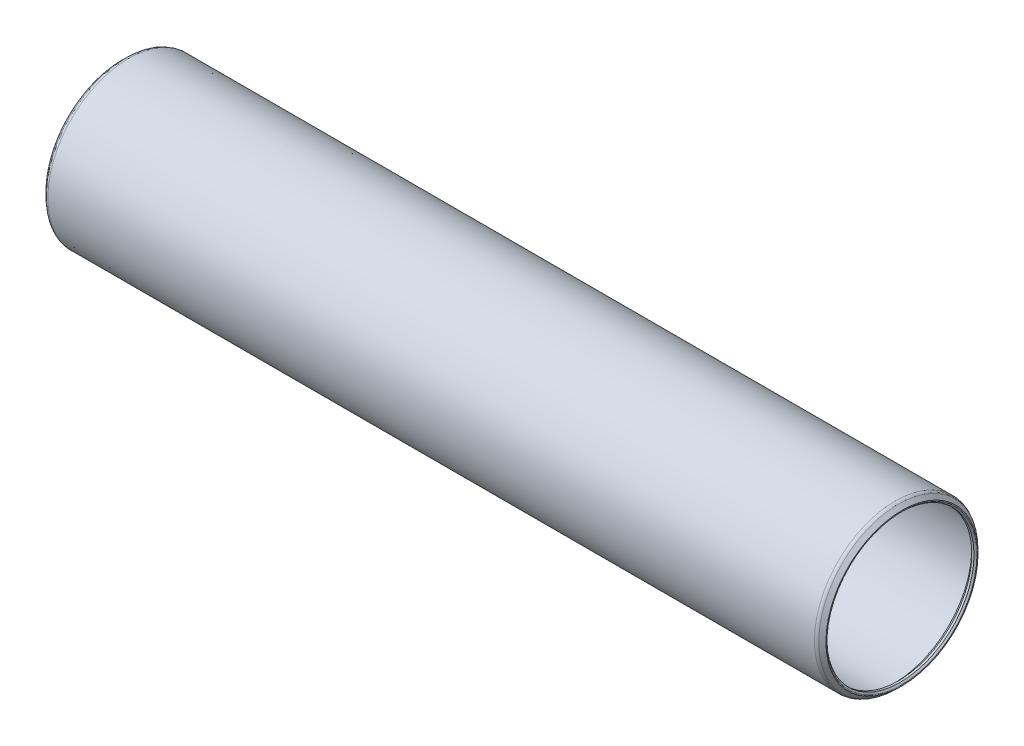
ISO-10303-21;
HEADER;
FILE_DESCRIPTION(('STEP AP214'),'2;1');
FILE_NAME('part.step','',(''),(''),'','','');
FILE_SCHEMA(('AUTOMOTIVE_DESIGN { 1 0 10303 214 1 1 1 1 }'));
ENDSEC;
DATA;
#1=APPLICATION_CONTEXT('core data for automotive mechanical design processes');
#2=APPLICATION_PROTOCOL_DEFINITION('international standard','automotive_design',2000,#1);
#3=PRODUCT_CONTEXT('',#1,'mechanical');
#4=PRODUCT('Part','Part','',(#3));
#5=PRODUCT_RELATED_PRODUCT_CATEGORY('part','',(#4));
#6=PRODUCT_DEFINITION_FORMATION('','',#4);
#7=PRODUCT_DEFINITION_CONTEXT('part definition',#1,'design');
#8=PRODUCT_DEFINITION('design','',#6,#7);
#9=PRODUCT_DEFINITION_SHAPE('','',#8);
#10=(LENGTH_UNIT() NAMED_UNIT(*) SI_UNIT(.MILLI.,.METRE.));
#11=(NAMED_UNIT(*) PLANE_ANGLE_UNIT() SI_UNIT($,.RADIAN.));
#12=(NAMED_UNIT(*) SI_UNIT($,.STERADIAN.) SOLID_ANGLE_UNIT());
#13=UNCERTAINTY_MEASURE_WITH_UNIT(LENGTH_MEASURE(1.E-05),#10,'distance_accuracy_value','');
#14=(GEOMETRIC_REPRESENTATION_CONTEXT(3) GLOBAL_UNCERTAINTY_ASSIGNED_CONTEXT((#13)) GLOBAL_UNIT_ASSIGNED_CONTEXT((#10,
#11,#12)) REPRESENTATION_CONTEXT('',''));
#15=CARTESIAN_POINT('',(0.,0.,0.));
#16=DIRECTION('',(0.,0.,1.));
#17=DIRECTION('',(1.,0.,0.));
#18=AXIS2_PLACEMENT_3D('',#15,#16,#17);
#19=CARTESIAN_POINT('',(134.9629,0.,0.));
#20=DIRECTION('',(-1.,0.,0.));
#21=DIRECTION('',(0.,0.,1.));
#22=AXIS2_PLACEMENT_3D('',#19,#20,#21);
#23=CYLINDRICAL_SURFACE('',#22,13.60805);
#24=CARTESIAN_POINT('',(0.762000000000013,0.,0.));
#25=DIRECTION('',(1.,0.,0.));
#26=DIRECTION('',(0.,0.,-1.));
#27=AXIS2_PLACEMENT_3D('',#24,#25,#26);
#28=CIRCLE('',#27,13.60805);
#29=CARTESIAN_POINT('',(0.762000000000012,0.,-13.60805));
#30=VERTEX_POINT('',#29);
#31=EDGE_CURVE('E117',#30,#30,#28,.F.);
#32=ORIENTED_EDGE('',*,*,#31,.T.);
#33=EDGE_LOOP('',(#32));
#34=FACE_BOUND('',#33,.T.);
#35=CARTESIAN_POINT('',(134.2009,0.,0.));
#36=DIRECTION('',(-1.,0.,0.));
#37=DIRECTION('',(0.,0.,1.));
#38=AXIS2_PLACEMENT_3D('',#35,#36,#37);
#39=CIRCLE('',#38,13.60805);
#40=CARTESIAN_POINT('',(134.2009,0.,13.60805));
#41=VERTEX_POINT('',#40);
#42=EDGE_CURVE('E112',#41,#41,#39,.F.);
#43=ORIENTED_EDGE('',*,*,#42,.T.);
#44=EDGE_LOOP('',(#43));
#45=FACE_BOUND('',#44,.T.);
#46=ADVANCED_FACE('F15',(#34,#45),#23,.F.);
#47=CARTESIAN_POINT('',(0.762000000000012,0.,0.));
#48=DIRECTION('',(1.,0.,0.));
#49=DIRECTION('',(0.,1.,0.));
#50=AXIS2_PLACEMENT_3D('',#47,#48,#49);
#51=CONICAL_SURFACE('',#50,13.60805,0.78539816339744);
#52=CARTESIAN_POINT('',(0.,0.,0.));
#53=DIRECTION('',(-1.,0.,0.));
#54=DIRECTION('',(0.,0.,1.));
#55=AXIS2_PLACEMENT_3D('',#52,#53,#54);
#56=CIRCLE('',#55,12.84605);
#57=CARTESIAN_POINT('',(0.,0.,12.84605));
#58=VERTEX_POINT('',#57);
#59=EDGE_CURVE('E107',#58,#58,#56,.T.);
#60=ORIENTED_EDGE('',*,*,#59,.T.);
#61=EDGE_LOOP('',(#60));
#62=FACE_BOUND('',#61,.T.);
#63=ORIENTED_EDGE('',*,*,#31,.F.);
#64=EDGE_LOOP('',(#63));
#65=FACE_BOUND('',#64,.T.);
#66=ADVANCED_FACE('F124',(#62,#65),#51,.F.);
#67=CARTESIAN_POINT('',(134.2009,0.,0.));
#68=DIRECTION('',(-1.,0.,0.));
#69=DIRECTION('',(0.,0.,1.));
#70=AXIS2_PLACEMENT_3D('',#67,#68,#69);
#71=CONICAL_SURFACE('',#70,13.60805,0.785398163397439);
#72=ORIENTED_EDGE('',*,*,#42,.F.);
#73=EDGE_LOOP('',(#72));
#74=FACE_BOUND('',#73,.T.);
#75=CARTESIAN_POINT('',(134.9629,0.,0.));
#76=DIRECTION('',(-1.,0.,0.));
#77=DIRECTION('',(0.,0.,1.));
#78=AXIS2_PLACEMENT_3D('',#75,#76,#77);
#79=CIRCLE('',#78,12.84605);
#80=CARTESIAN_POINT('',(134.9629,0.,12.84605));
#81=VERTEX_POINT('',#80);
#82=EDGE_CURVE('E102',#81,#81,#79,.F.);
#83=ORIENTED_EDGE('',*,*,#82,.T.);
#84=EDGE_LOOP('',(#83));
#85=FACE_BOUND('',#84,.T.);
#86=ADVANCED_FACE('F126',(#74,#85),#71,.F.);
#87=CARTESIAN_POINT('',(134.9629,0.,0.));
#88=DIRECTION('',(-1.,0.,0.));
#89=DIRECTION('',(0.,0.,1.));
#90=AXIS2_PLACEMENT_3D('',#87,#88,#89);
#91=CYLINDRICAL_SURFACE('',#90,12.84605);
#92=CARTESIAN_POINT('',(-0.380999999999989,0.,0.));
#93=DIRECTION('',(-1.,0.,0.));
#94=DIRECTION('',(0.,0.,1.));
#95=AXIS2_PLACEMENT_3D('',#92,#93,#94);
#96=CIRCLE('',#95,12.84605);
#97=CARTESIAN_POINT('',(-0.380999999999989,0.,12.84605));
#98=VERTEX_POINT('',#97);
#99=EDGE_CURVE('E97',#98,#98,#96,.T.);
#100=ORIENTED_EDGE('',*,*,#99,.T.);
#101=EDGE_LOOP('',(#100));
#102=FACE_BOUND('',#101,.T.);
#103=ORIENTED_EDGE('',*,*,#59,.F.);
#104=EDGE_LOOP('',(#103));
#105=FACE_BOUND('',#104,.T.);
#106=ADVANCED_FACE('F133',(#102,#105),#91,.F.);
#107=CARTESIAN_POINT('',(134.9629,0.,0.));
#108=DIRECTION('',(-1.,0.,0.));
#109=DIRECTION('',(0.,0.,1.));
#110=AXIS2_PLACEMENT_3D('',#107,#108,#109);
#111=CYLINDRICAL_SURFACE('',#110,12.84605);
#112=ORIENTED_EDGE('',*,*,#82,.F.);
#113=EDGE_LOOP('',(#112));
#114=FACE_BOUND('',#113,.T.);
#115=CARTESIAN_POINT('',(135.3439,0.,0.));
#116=DIRECTION('',(1.,0.,0.));
#117=DIRECTION('',(0.,0.,-1.));
#118=AXIS2_PLACEMENT_3D('',#115,#116,#117);
#119=CIRCLE('',#118,12.84605);
#120=CARTESIAN_POINT('',(135.3439,0.,-12.84605));
#121=VERTEX_POINT('',#120);
#122=EDGE_CURVE('E92',#121,#121,#119,.T.);
#123=ORIENTED_EDGE('',*,*,#122,.T.);
#124=EDGE_LOOP('',(#123));
#125=FACE_BOUND('',#124,.T.);
#126=ADVANCED_FACE('F153',(#114,#125),#111,.F.);
#127=CARTESIAN_POINT('',(-0.639512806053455,0.,0.));
#128=DIRECTION('',(-1.,0.,0.));
#129=DIRECTION('',(0.,0.,1.));
#130=AXIS2_PLACEMENT_3D('',#127,#128,#129);
#131=CONICAL_SURFACE('',#130,13.1045628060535,0.785398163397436);
#132=CARTESIAN_POINT('',(-0.639512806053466,0.,0.));
#133=DIRECTION('',(1.,0.,0.));
#134=DIRECTION('',(0.,0.,-1.));
#135=AXIS2_PLACEMENT_3D('',#132,#133,#134);
#136=CIRCLE('',#135,13.1045628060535);
#137=CARTESIAN_POINT('',(-0.639512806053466,0.,-13.1045628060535));
#138=VERTEX_POINT('',#137);
#139=EDGE_CURVE('E89',#138,#138,#136,.T.);
#140=ORIENTED_EDGE('',*,*,#139,.F.);
#141=EDGE_LOOP('',(#140));
#142=FACE_BOUND('',#141,.T.);
#143=ORIENTED_EDGE('',*,*,#99,.F.);
#144=EDGE_LOOP('',(#143));
#145=FACE_BOUND('',#144,.T.);
#146=ADVANCED_FACE('F150',(#142,#145),#131,.F.);
#147=CARTESIAN_POINT('',(135.602412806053,0.,0.));
#148=DIRECTION('',(1.,0.,0.));
#149=DIRECTION('',(0.,0.,-1.));
#150=AXIS2_PLACEMENT_3D('',#147,#148,#149);
#151=CONICAL_SURFACE('',#150,13.1045628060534,0.785398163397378);
#152=ORIENTED_EDGE('',*,*,#122,.F.);
#153=EDGE_LOOP('',(#152));
#154=FACE_BOUND('',#153,.T.);
#155=CARTESIAN_POINT('',(135.602412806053,0.,0.));
#156=DIRECTION('',(1.,0.,0.));
#157=DIRECTION('',(0.,0.,-1.));
#158=AXIS2_PLACEMENT_3D('',#155,#156,#157);
#159=CIRCLE('',#158,13.1045628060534);
#160=CARTESIAN_POINT('',(135.602412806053,0.,-13.1045628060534));
#161=VERTEX_POINT('',#160);
#162=EDGE_CURVE('E67',#161,#161,#159,.F.);
#163=ORIENTED_EDGE('',*,*,#162,.F.);
#164=EDGE_LOOP('',(#163));
#165=FACE_BOUND('',#164,.T.);
#166=ADVANCED_FACE('F83',(#154,#165),#151,.F.);
#167=CARTESIAN_POINT('',(-0.549710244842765,0.,0.));
#168=DIRECTION('',(1.,0.,0.));
#169=DIRECTION('',(0.,0.,-1.));
#170=AXIS2_PLACEMENT_3D('',#167,#168,#169);
#171=TOROIDAL_SURFACE('',#170,13.1943653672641,0.127000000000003);
#172=CARTESIAN_POINT('',(-0.639512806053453,0.,0.));
#173=DIRECTION('',(1.,0.,0.));
#174=DIRECTION('',(0.,0.,-1.));
#175=AXIS2_PLACEMENT_3D('',#172,#173,#174);
#176=CIRCLE('',#175,13.2841679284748);
#177=CARTESIAN_POINT('',(-0.639512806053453,0.,-13.2841679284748));
#178=VERTEX_POINT('',#177);
#179=EDGE_CURVE('E62',#178,#178,#176,.T.);
#180=ORIENTED_EDGE('',*,*,#179,.F.);
#181=EDGE_LOOP('',(#180));
#182=FACE_BOUND('',#181,.T.);
#183=ORIENTED_EDGE('',*,*,#139,.T.);
#184=EDGE_LOOP('',(#183));
#185=FACE_BOUND('',#184,.T.);
#186=ADVANCED_FACE('F78',(#182,#185),#171,.T.);
#187=CARTESIAN_POINT('',(135.512610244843,0.,0.));
#188=DIRECTION('',(1.,0.,0.));
#189=DIRECTION('',(0.,0.,-1.));
#190=AXIS2_PLACEMENT_3D('',#187,#188,#189);
#191=TOROIDAL_SURFACE('',#190,13.1943653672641,0.127000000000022);
#192=ORIENTED_EDGE('',*,*,#162,.T.);
#193=EDGE_LOOP('',(#192));
#194=FACE_BOUND('',#193,.T.);
#195=CARTESIAN_POINT('',(135.602412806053,0.,0.));
#196=DIRECTION('',(-1.,0.,0.));
#197=DIRECTION('',(0.,0.,1.));
#198=AXIS2_PLACEMENT_3D('',#195,#196,#197);
#199=CIRCLE('',#198,13.2841679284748);
#200=CARTESIAN_POINT('',(135.602412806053,0.,13.2841679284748));
#201=VERTEX_POINT('',#200);
#202=EDGE_CURVE('E57',#201,#201,#199,.T.);
#203=ORIENTED_EDGE('',*,*,#202,.F.);
#204=EDGE_LOOP('',(#203));
#205=FACE_BOUND('',#204,.T.);
#206=ADVANCED_FACE('F74',(#194,#205),#191,.T.);
#207=CARTESIAN_POINT('',(-0.0117653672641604,0.,0.));
#208=DIRECTION('',(1.,0.,0.));
#209=DIRECTION('',(0.,1.,0.));
#210=AXIS2_PLACEMENT_3D('',#207,#208,#209);
#211=CONICAL_SURFACE('',#210,13.9119153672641,0.785398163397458);
#212=CARTESIAN_POINT('',(-0.0117653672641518,0.,0.));
#213=DIRECTION('',(1.,0.,0.));
#214=DIRECTION('',(0.,0.,-1.));
#215=AXIS2_PLACEMENT_3D('',#212,#213,#214);
#216=CIRCLE('',#215,13.9119153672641);
#217=CARTESIAN_POINT('',(-0.0117653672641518,0.,-13.9119153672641));
#218=VERTEX_POINT('',#217);
#219=EDGE_CURVE('E54',#218,#218,#216,.T.);
#220=ORIENTED_EDGE('',*,*,#219,.F.);
#221=EDGE_LOOP('',(#220));
#222=FACE_BOUND('',#221,.T.);
#223=ORIENTED_EDGE('',*,*,#179,.T.);
#224=EDGE_LOOP('',(#223));
#225=FACE_BOUND('',#224,.T.);
#226=ADVANCED_FACE('F77',(#222,#225),#211,.T.);
#227=CARTESIAN_POINT('',(134.974665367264,0.,0.));
#228=DIRECTION('',(-1.,0.,0.));
#229=DIRECTION('',(0.,0.,1.));
#230=AXIS2_PLACEMENT_3D('',#227,#228,#229);
#231=CONICAL_SURFACE('',#230,13.911915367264,0.785398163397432);
#232=ORIENTED_EDGE('',*,*,#202,.T.);
#233=EDGE_LOOP('',(#232));
#234=FACE_BOUND('',#233,.T.);
#235=CARTESIAN_POINT('',(134.974665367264,0.,0.));
#236=DIRECTION('',(1.,0.,0.));
#237=DIRECTION('',(0.,0.,-1.));
#238=AXIS2_PLACEMENT_3D('',#235,#236,#237);
#239=CIRCLE('',#238,13.9119153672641);
#240=CARTESIAN_POINT('',(134.974665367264,0.,-13.9119153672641));
#241=VERTEX_POINT('',#240);
#242=EDGE_CURVE('E27',#241,#241,#239,.F.);
#243=ORIENTED_EDGE('',*,*,#242,.F.);
#244=EDGE_LOOP('',(#243));
#245=FACE_BOUND('',#244,.T.);
#246=ADVANCED_FACE('F48',(#234,#245),#231,.T.);
#247=CARTESIAN_POINT('',(0.52705,0.,0.));
#248=DIRECTION('',(1.,0.,0.));
#249=DIRECTION('',(0.,0.,-1.));
#250=AXIS2_PLACEMENT_3D('',#247,#248,#249);
#251=TOROIDAL_SURFACE('',#250,13.3731,0.76199999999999);
#252=CARTESIAN_POINT('',(0.527049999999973,0.,0.));
#253=DIRECTION('',(-1.,0.,0.));
#254=DIRECTION('',(0.,0.,1.));
#255=AXIS2_PLACEMENT_3D('',#252,#253,#254);
#256=CIRCLE('',#255,14.1351);
#257=CARTESIAN_POINT('',(0.527049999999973,0.,14.1351));
#258=VERTEX_POINT('',#257);
#259=EDGE_CURVE('E22',#258,#258,#256,.F.);
#260=ORIENTED_EDGE('',*,*,#259,.F.);
#261=EDGE_LOOP('',(#260));
#262=FACE_BOUND('',#261,.T.);
#263=ORIENTED_EDGE('',*,*,#219,.T.);
#264=EDGE_LOOP('',(#263));
#265=FACE_BOUND('',#264,.T.);
#266=ADVANCED_FACE('F43',(#262,#265),#251,.T.);
#267=CARTESIAN_POINT('',(134.43585,0.,0.));
#268=DIRECTION('',(1.,0.,0.));
#269=DIRECTION('',(0.,0.,-1.));
#270=AXIS2_PLACEMENT_3D('',#267,#268,#269);
#271=TOROIDAL_SURFACE('',#270,13.3731000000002,0.761999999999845);
#272=ORIENTED_EDGE('',*,*,#242,.T.);
#273=EDGE_LOOP('',(#272));
#274=FACE_BOUND('',#273,.T.);
#275=CARTESIAN_POINT('',(134.43585,0.,0.));
#276=DIRECTION('',(-1.,0.,0.));
#277=DIRECTION('',(0.,0.,1.));
#278=AXIS2_PLACEMENT_3D('',#275,#276,#277);
#279=CIRCLE('',#278,14.1351);
#280=CARTESIAN_POINT('',(134.43585,0.,14.1351));
#281=VERTEX_POINT('',#280);
#282=EDGE_CURVE('E10',#281,#281,#279,.T.);
#283=ORIENTED_EDGE('',*,*,#282,.F.);
#284=EDGE_LOOP('',(#283));
#285=FACE_BOUND('',#284,.T.);
#286=ADVANCED_FACE('F38',(#274,#285),#271,.T.);
#287=CARTESIAN_POINT('',(134.9629,0.,0.));
#288=DIRECTION('',(-1.,0.,0.));
#289=DIRECTION('',(0.,0.,1.));
#290=AXIS2_PLACEMENT_3D('',#287,#288,#289);
#291=CYLINDRICAL_SURFACE('',#290,14.1351);
#292=ORIENTED_EDGE('',*,*,#282,.T.);
#293=EDGE_LOOP('',(#292));
#294=FACE_BOUND('',#293,.T.);
#295=ORIENTED_EDGE('',*,*,#259,.T.);
#296=EDGE_LOOP('',(#295));
#297=FACE_BOUND('',#296,.T.);
#298=ADVANCED_FACE('F42',(#294,#297),#291,.T.);
#299=CLOSED_SHELL('',(#46,#66,#86,#106,#126,#146,#166,#186,#206,#226,#246,#266,#286,#298));
#300=MANIFOLD_SOLID_BREP('B1',#299);
#301=ADVANCED_BREP_SHAPE_REPRESENTATION('',(#18,#300),#14);
#302=SHAPE_DEFINITION_REPRESENTATION(#9,#301);
ENDSEC;
END-ISO-10303-21;
